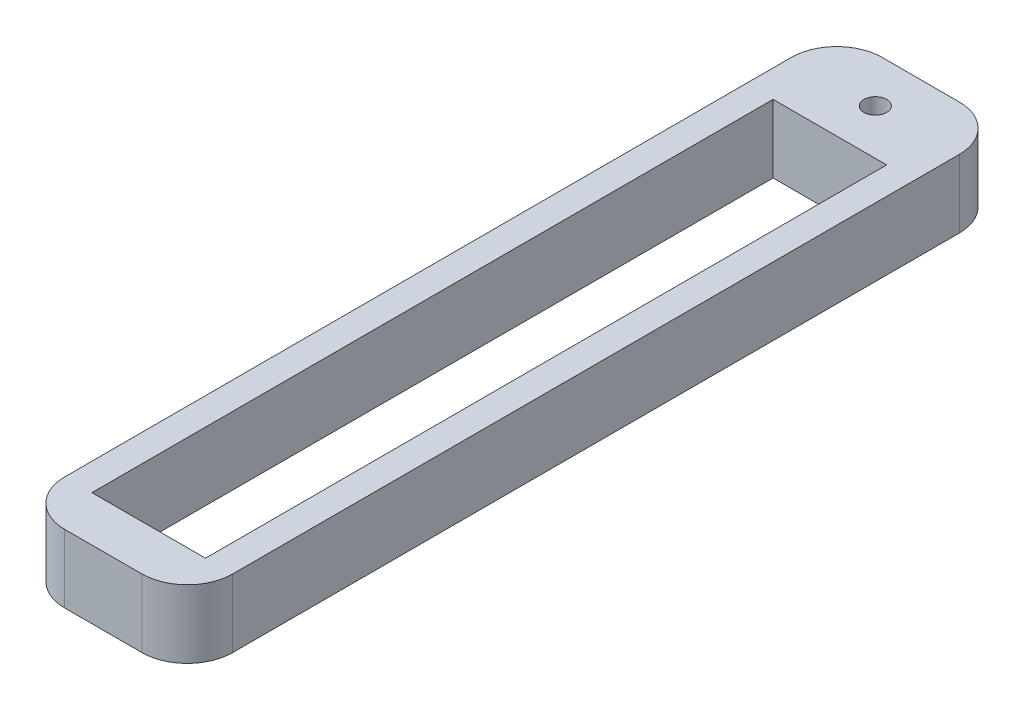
from build123d import *

# Parameters (mm, degrees)
CROQUIS1_R              = 0.5
CROQUIS1_W              = 5
CROQUIS1_H              = 30
SALIENTE_EXTRUIR1_DEPTH = 3


with BuildPart() as part:
    # Croquis1 → Saliente-Extruir1 (new body)
    with BuildSketch(Plane(origin=(0, 0, 0), x_dir=(1, 0, 0), z_dir=(0, 1, 0))):
        with BuildLine():
            Line((0.8, -2), (4.2, -2))
            ThreePointArc((4.2, -2), (5.614213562, -1.414213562), (6.2, 0))
            Line((6.2, 0), (6.2, 32))
            ThreePointArc((6.2, 32), (5.614213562, 33.414213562), (4.2, 34))
            Line((4.2, 34), (0.8, 34))
            ThreePointArc((0.8, 34), (-0.614213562, 33.414213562), (-1.2, 32))
            Line((-1.2, 32), (-1.2, 0))
            ThreePointArc((-1.2, 0), (-0.614213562, -1.414213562), (0.8, -2))
        make_face()
        with Locations(Location((2.5, 32, 0), (0, 0, 270))):
            Circle(CROQUIS1_R, mode=Mode.SUBTRACT)
        with Locations((2.5, 15)):
            Rectangle(CROQUIS1_W, CROQUIS1_H, mode=Mode.SUBTRACT)
    extrude(amount=SALIENTE_EXTRUIR1_DEPTH)


solid = part.part
